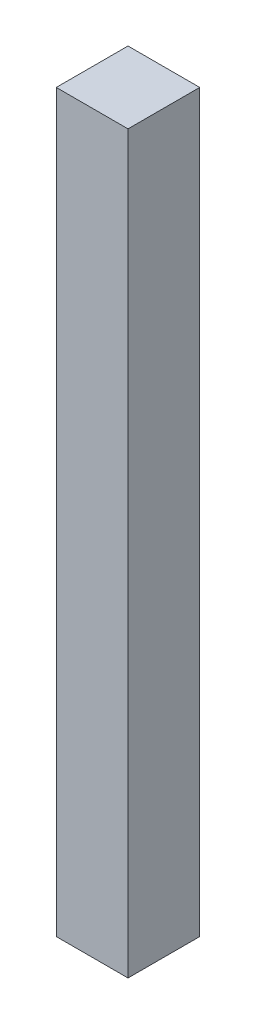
ISO-10303-21;
HEADER;
FILE_DESCRIPTION(('STEP AP214'),'2;1');
FILE_NAME('part.step','',(''),(''),'','','');
FILE_SCHEMA(('AUTOMOTIVE_DESIGN { 1 0 10303 214 1 1 1 1 }'));
ENDSEC;
DATA;
#1=APPLICATION_CONTEXT('core data for automotive mechanical design processes');
#2=APPLICATION_PROTOCOL_DEFINITION('international standard','automotive_design',2000,#1);
#3=PRODUCT_CONTEXT('',#1,'mechanical');
#4=PRODUCT('Part','Part','',(#3));
#5=PRODUCT_RELATED_PRODUCT_CATEGORY('part','',(#4));
#6=PRODUCT_DEFINITION_FORMATION('','',#4);
#7=PRODUCT_DEFINITION_CONTEXT('part definition',#1,'design');
#8=PRODUCT_DEFINITION('design','',#6,#7);
#9=PRODUCT_DEFINITION_SHAPE('','',#8);
#10=(LENGTH_UNIT() NAMED_UNIT(*) SI_UNIT(.MILLI.,.METRE.));
#11=(NAMED_UNIT(*) PLANE_ANGLE_UNIT() SI_UNIT($,.RADIAN.));
#12=(NAMED_UNIT(*) SI_UNIT($,.STERADIAN.) SOLID_ANGLE_UNIT());
#13=UNCERTAINTY_MEASURE_WITH_UNIT(LENGTH_MEASURE(1.E-05),#10,'distance_accuracy_value','');
#14=(GEOMETRIC_REPRESENTATION_CONTEXT(3) GLOBAL_UNCERTAINTY_ASSIGNED_CONTEXT((#13)) GLOBAL_UNIT_ASSIGNED_CONTEXT((#10,
#11,#12)) REPRESENTATION_CONTEXT('',''));
#15=CARTESIAN_POINT('',(0.,0.,0.));
#16=DIRECTION('',(0.,0.,1.));
#17=DIRECTION('',(1.,0.,0.));
#18=AXIS2_PLACEMENT_3D('',#15,#16,#17);
#19=CARTESIAN_POINT('',(450.000000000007,409.999999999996,-40.));
#20=DIRECTION('',(1.,0.,0.));
#21=DIRECTION('',(0.,0.,-1.));
#22=AXIS2_PLACEMENT_3D('',#19,#20,#21);
#23=PLANE('',#22);
#24=DIRECTION('',(0.,1.,0.));
#25=VECTOR('',#24,1.);
#26=CARTESIAN_POINT('',(450.000000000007,409.999999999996,0.));
#27=LINE('',#26,#25);
#28=CARTESIAN_POINT('',(450.000000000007,0.,0.));
#29=VERTEX_POINT('',#28);
#30=CARTESIAN_POINT('',(450.000000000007,409.999999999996,0.));
#31=VERTEX_POINT('',#30);
#32=EDGE_CURVE('E97',#29,#31,#27,.T.);
#33=ORIENTED_EDGE('',*,*,#32,.F.);
#34=DIRECTION('',(0.,0.,1.));
#35=VECTOR('',#34,1.);
#36=CARTESIAN_POINT('',(450.000000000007,0.,-40.));
#37=LINE('',#36,#35);
#38=CARTESIAN_POINT('',(450.000000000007,0.,-40.));
#39=VERTEX_POINT('',#38);
#40=EDGE_CURVE('E11',#39,#29,#37,.T.);
#41=ORIENTED_EDGE('',*,*,#40,.F.);
#42=DIRECTION('',(0.,1.,0.));
#43=VECTOR('',#42,1.);
#44=CARTESIAN_POINT('',(450.000000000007,409.999999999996,-40.));
#45=LINE('',#44,#43);
#46=CARTESIAN_POINT('',(450.000000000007,409.999999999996,-40.));
#47=VERTEX_POINT('',#46);
#48=EDGE_CURVE('E91',#39,#47,#45,.T.);
#49=ORIENTED_EDGE('',*,*,#48,.T.);
#50=DIRECTION('',(0.,0.,1.));
#51=VECTOR('',#50,1.);
#52=CARTESIAN_POINT('',(450.000000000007,409.999999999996,-40.));
#53=LINE('',#52,#51);
#54=EDGE_CURVE('E36',#47,#31,#53,.T.);
#55=ORIENTED_EDGE('',*,*,#54,.T.);
#56=EDGE_LOOP('',(#33,#41,#49,#55));
#57=FACE_BOUND('',#56,.T.);
#58=ADVANCED_FACE('F33',(#57),#23,.T.);
#59=CARTESIAN_POINT('',(450.000000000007,0.,-40.));
#60=DIRECTION('',(0.,-1.,0.));
#61=DIRECTION('',(0.,0.,-1.));
#62=AXIS2_PLACEMENT_3D('',#59,#60,#61);
#63=PLANE('',#62);
#64=DIRECTION('',(1.,0.,0.));
#65=VECTOR('',#64,1.);
#66=CARTESIAN_POINT('',(450.000000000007,0.,0.));
#67=LINE('',#66,#65);
#68=CARTESIAN_POINT('',(410.,0.,0.));
#69=VERTEX_POINT('',#68);
#70=EDGE_CURVE('E93',#69,#29,#67,.T.);
#71=ORIENTED_EDGE('',*,*,#70,.F.);
#72=DIRECTION('',(0.,0.,1.));
#73=VECTOR('',#72,1.);
#74=CARTESIAN_POINT('',(410.,0.,-40.));
#75=LINE('',#74,#73);
#76=CARTESIAN_POINT('',(410.,0.,-40.));
#77=VERTEX_POINT('',#76);
#78=EDGE_CURVE('E42',#77,#69,#75,.T.);
#79=ORIENTED_EDGE('',*,*,#78,.F.);
#80=DIRECTION('',(1.,0.,0.));
#81=VECTOR('',#80,1.);
#82=CARTESIAN_POINT('',(450.000000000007,0.,-40.));
#83=LINE('',#82,#81);
#84=EDGE_CURVE('E88',#77,#39,#83,.T.);
#85=ORIENTED_EDGE('',*,*,#84,.T.);
#86=ORIENTED_EDGE('',*,*,#40,.T.);
#87=EDGE_LOOP('',(#71,#79,#85,#86));
#88=FACE_BOUND('',#87,.T.);
#89=ADVANCED_FACE('F107',(#88),#63,.T.);
#90=CARTESIAN_POINT('',(410.,409.999999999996,-40.));
#91=DIRECTION('',(-1.,0.,0.));
#92=DIRECTION('',(0.,0.,1.));
#93=AXIS2_PLACEMENT_3D('',#90,#91,#92);
#94=PLANE('',#93);
#95=DIRECTION('',(0.,-1.,0.));
#96=VECTOR('',#95,1.);
#97=CARTESIAN_POINT('',(410.,409.999999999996,0.));
#98=LINE('',#97,#96);
#99=CARTESIAN_POINT('',(410.,409.999999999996,0.));
#100=VERTEX_POINT('',#99);
#101=EDGE_CURVE('E83',#100,#69,#98,.T.);
#102=ORIENTED_EDGE('',*,*,#101,.F.);
#103=DIRECTION('',(0.,0.,1.));
#104=VECTOR('',#103,1.);
#105=CARTESIAN_POINT('',(410.,409.999999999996,-40.));
#106=LINE('',#105,#104);
#107=CARTESIAN_POINT('',(410.,409.999999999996,-40.));
#108=VERTEX_POINT('',#107);
#109=EDGE_CURVE('E78',#108,#100,#106,.T.);
#110=ORIENTED_EDGE('',*,*,#109,.F.);
#111=DIRECTION('',(0.,-1.,0.));
#112=VECTOR('',#111,1.);
#113=CARTESIAN_POINT('',(410.,409.999999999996,-40.));
#114=LINE('',#113,#112);
#115=EDGE_CURVE('E81',#108,#77,#114,.T.);
#116=ORIENTED_EDGE('',*,*,#115,.T.);
#117=ORIENTED_EDGE('',*,*,#78,.T.);
#118=EDGE_LOOP('',(#102,#110,#116,#117));
#119=FACE_BOUND('',#118,.T.);
#120=ADVANCED_FACE('F80',(#119),#94,.T.);
#121=CARTESIAN_POINT('',(450.000000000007,409.999999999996,-40.));
#122=DIRECTION('',(0.,1.,0.));
#123=DIRECTION('',(0.,0.,1.));
#124=AXIS2_PLACEMENT_3D('',#121,#122,#123);
#125=PLANE('',#124);
#126=DIRECTION('',(-1.,0.,0.));
#127=VECTOR('',#126,1.);
#128=CARTESIAN_POINT('',(450.000000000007,409.999999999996,0.));
#129=LINE('',#128,#127);
#130=EDGE_CURVE('E100',#31,#100,#129,.T.);
#131=ORIENTED_EDGE('',*,*,#130,.F.);
#132=ORIENTED_EDGE('',*,*,#54,.F.);
#133=DIRECTION('',(-1.,0.,0.));
#134=VECTOR('',#133,1.);
#135=CARTESIAN_POINT('',(450.000000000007,409.999999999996,-40.));
#136=LINE('',#135,#134);
#137=EDGE_CURVE('E87',#47,#108,#136,.T.);
#138=ORIENTED_EDGE('',*,*,#137,.T.);
#139=ORIENTED_EDGE('',*,*,#109,.T.);
#140=EDGE_LOOP('',(#131,#132,#138,#139));
#141=FACE_BOUND('',#140,.T.);
#142=ADVANCED_FACE('F90',(#141),#125,.T.);
#143=CARTESIAN_POINT('',(0.,0.,-40.));
#144=DIRECTION('',(0.,0.,-1.));
#145=DIRECTION('',(-1.,0.,0.));
#146=AXIS2_PLACEMENT_3D('',#143,#144,#145);
#147=PLANE('',#146);
#148=ORIENTED_EDGE('',*,*,#48,.F.);
#149=ORIENTED_EDGE('',*,*,#84,.F.);
#150=ORIENTED_EDGE('',*,*,#115,.F.);
#151=ORIENTED_EDGE('',*,*,#137,.F.);
#152=EDGE_LOOP('',(#148,#149,#150,#151));
#153=FACE_BOUND('',#152,.T.);
#154=ADVANCED_FACE('F86',(#153),#147,.T.);
#155=CARTESIAN_POINT('',(0.,0.,0.));
#156=DIRECTION('',(0.,0.,-1.));
#157=DIRECTION('',(-1.,0.,0.));
#158=AXIS2_PLACEMENT_3D('',#155,#156,#157);
#159=PLANE('',#158);
#160=ORIENTED_EDGE('',*,*,#32,.T.);
#161=ORIENTED_EDGE('',*,*,#130,.T.);
#162=ORIENTED_EDGE('',*,*,#101,.T.);
#163=ORIENTED_EDGE('',*,*,#70,.T.);
#164=EDGE_LOOP('',(#160,#161,#162,#163));
#165=FACE_BOUND('',#164,.T.);
#166=ADVANCED_FACE('F106',(#165),#159,.F.);
#167=CLOSED_SHELL('',(#58,#89,#120,#142,#154,#166));
#168=MANIFOLD_SOLID_BREP('B2',#167);
#169=ADVANCED_BREP_SHAPE_REPRESENTATION('',(#18,#168),#14);
#170=SHAPE_DEFINITION_REPRESENTATION(#9,#169);
ENDSEC;
END-ISO-10303-21;
